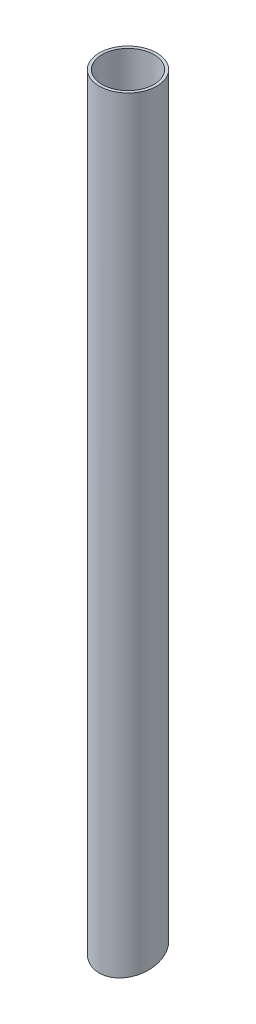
from build123d import *

# Parameters (mm, degrees)
SKIZZE1_R                            = 15
SKIZZE1_R_2                          = 13.5
LINEAR_AUSTRAGEN_D_NN1_DEPTH         = 400
SCHNITT_LINEAR_AUSTRAGEN1_DEPTH      = 401.562105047
SCHNITT_LINEAR_AUSTRAGEN1_DEPTH_BACK = 401.562105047


with BuildPart() as part:
    # Skizze1 → Linear-Austragen-D_nn1 (new body)
    with BuildSketch(Plane(origin=(0, 0, 0), x_dir=(1, 0, 0), z_dir=(0, 1, 0))):
        Circle(SKIZZE1_R)
        Circle(SKIZZE1_R_2, mode=Mode.SUBTRACT)
    extrude(amount=LINEAR_AUSTRAGEN_D_NN1_DEPTH)

    # Skizze6 → Schnitt-Linear austragen1 (cut, two sides: drawn at the far end of the back side and taken through both)
    with BuildSketch(Plane(origin=(0, 0, 0), x_dir=(0, 0, -1), z_dir=(1, 0, 0)).offset(-SCHNITT_LINEAR_AUSTRAGEN1_DEPTH_BACK)):
        Polygon((799.570204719, 218.263428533), (15, 8.038475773), (-15, 0), (-799.570204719, -210.22495276), (-379.120299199, -1779.365362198), (1220.020110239, -1350.876980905), align=None)
    extrude(amount=SCHNITT_LINEAR_AUSTRAGEN1_DEPTH + SCHNITT_LINEAR_AUSTRAGEN1_DEPTH_BACK, mode=Mode.SUBTRACT)


solid = part.part
